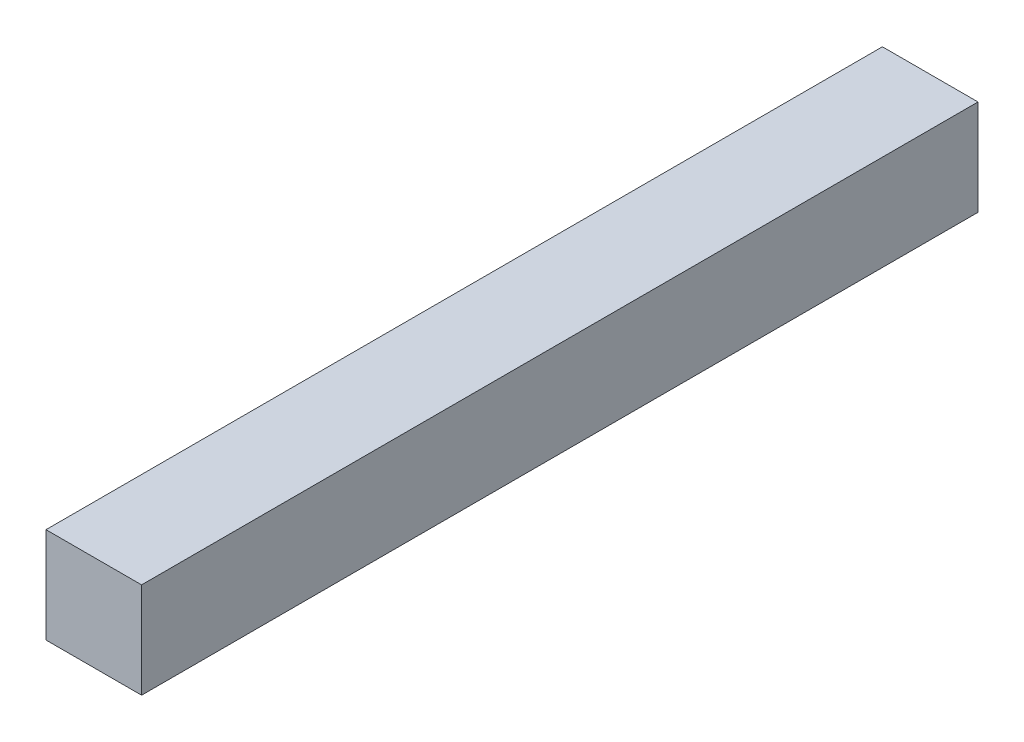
from build123d import *

# Parameters (mm, degrees)
SKETCH1_W           = 80
SKETCH1_H           = 80
BOSS_EXTRUDE1_DEPTH = 350
SKETCH2_R           = 30
CUT_EXTRUDE1_DEPTH  = 10
SKETCH3_R           = 35
CUT_EXTRUDE2_DEPTH  = 10


with BuildPart() as part:
    # Sketch1 → Boss-Extrude1 (new, symmetric)
    with BuildSketch(Plane.XY):
        Rectangle(SKETCH1_W, SKETCH1_H)
    extrude(amount=BOSS_EXTRUDE1_DEPTH, both=True)

    # Sketch2 → Cut-Extrude1 (cut)
    with BuildSketch(Plane(origin=(0, 0, -350), x_dir=(-1, 0, 0), z_dir=(0, 0, -1))):
        Circle(SKETCH2_R)
    extrude(amount=-CUT_EXTRUDE1_DEPTH, mode=Mode.SUBTRACT)

    # Sketch3 → Cut-Extrude2 (cut)
    with BuildSketch(Plane(origin=(0, 0, -340), x_dir=(-1, 0, 0), z_dir=(0, 0, -1))):
        Circle(SKETCH3_R)
    extrude(amount=-CUT_EXTRUDE2_DEPTH, mode=Mode.SUBTRACT)


solid = part.part
